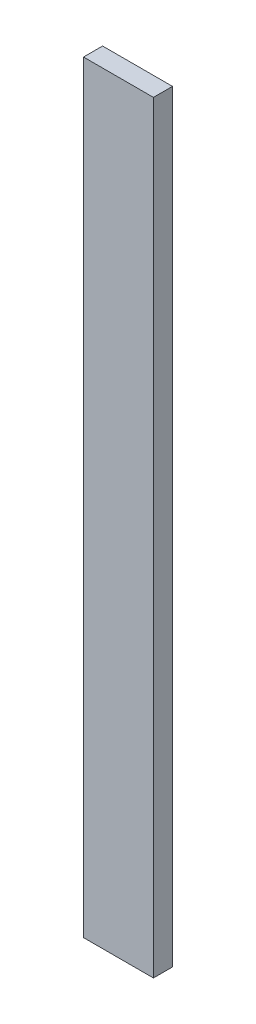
ISO-10303-21;
HEADER;
FILE_DESCRIPTION(('STEP AP214'),'2;1');
FILE_NAME('part.step','',(''),(''),'','','');
FILE_SCHEMA(('AUTOMOTIVE_DESIGN { 1 0 10303 214 1 1 1 1 }'));
ENDSEC;
DATA;
#1=APPLICATION_CONTEXT('core data for automotive mechanical design processes');
#2=APPLICATION_PROTOCOL_DEFINITION('international standard','automotive_design',2000,#1);
#3=PRODUCT_CONTEXT('',#1,'mechanical');
#4=PRODUCT('Part','Part','',(#3));
#5=PRODUCT_RELATED_PRODUCT_CATEGORY('part','',(#4));
#6=PRODUCT_DEFINITION_FORMATION('','',#4);
#7=PRODUCT_DEFINITION_CONTEXT('part definition',#1,'design');
#8=PRODUCT_DEFINITION('design','',#6,#7);
#9=PRODUCT_DEFINITION_SHAPE('','',#8);
#10=(LENGTH_UNIT() NAMED_UNIT(*) SI_UNIT(.MILLI.,.METRE.));
#11=(NAMED_UNIT(*) PLANE_ANGLE_UNIT() SI_UNIT($,.RADIAN.));
#12=(NAMED_UNIT(*) SI_UNIT($,.STERADIAN.) SOLID_ANGLE_UNIT());
#13=UNCERTAINTY_MEASURE_WITH_UNIT(LENGTH_MEASURE(1.E-05),#10,'distance_accuracy_value','');
#14=(GEOMETRIC_REPRESENTATION_CONTEXT(3) GLOBAL_UNCERTAINTY_ASSIGNED_CONTEXT((#13)) GLOBAL_UNIT_ASSIGNED_CONTEXT((#10,
#11,#12)) REPRESENTATION_CONTEXT('',''));
#15=CARTESIAN_POINT('',(0.,0.,0.));
#16=DIRECTION('',(0.,0.,1.));
#17=DIRECTION('',(1.,0.,0.));
#18=AXIS2_PLACEMENT_3D('',#15,#16,#17);
#19=CARTESIAN_POINT('',(69.85,1524.,-19.05));
#20=DIRECTION('',(-1.,0.,0.));
#21=DIRECTION('',(0.,0.,1.));
#22=AXIS2_PLACEMENT_3D('',#19,#20,#21);
#23=PLANE('',#22);
#24=DIRECTION('',(0.,0.,-1.));
#25=VECTOR('',#24,1.);
#26=CARTESIAN_POINT('',(69.85,0.,-19.05));
#27=LINE('',#26,#25);
#28=CARTESIAN_POINT('',(69.85,0.,19.05));
#29=VERTEX_POINT('',#28);
#30=CARTESIAN_POINT('',(69.85,0.,-19.05));
#31=VERTEX_POINT('',#30);
#32=EDGE_CURVE('E99',#29,#31,#27,.T.);
#33=ORIENTED_EDGE('',*,*,#32,.T.);
#34=DIRECTION('',(0.,-1.,0.));
#35=VECTOR('',#34,1.);
#36=CARTESIAN_POINT('',(69.85,1524.,-19.05));
#37=LINE('',#36,#35);
#38=CARTESIAN_POINT('',(69.85,1524.,-19.05));
#39=VERTEX_POINT('',#38);
#40=EDGE_CURVE('E11',#39,#31,#37,.T.);
#41=ORIENTED_EDGE('',*,*,#40,.F.);
#42=DIRECTION('',(0.,0.,-1.));
#43=VECTOR('',#42,1.);
#44=CARTESIAN_POINT('',(69.85,1524.,-19.05));
#45=LINE('',#44,#43);
#46=CARTESIAN_POINT('',(69.85,1524.,19.05));
#47=VERTEX_POINT('',#46);
#48=EDGE_CURVE('E87',#47,#39,#45,.T.);
#49=ORIENTED_EDGE('',*,*,#48,.F.);
#50=DIRECTION('',(0.,-1.,0.));
#51=VECTOR('',#50,1.);
#52=CARTESIAN_POINT('',(69.85,1524.,19.05));
#53=LINE('',#52,#51);
#54=EDGE_CURVE('E95',#47,#29,#53,.T.);
#55=ORIENTED_EDGE('',*,*,#54,.T.);
#56=EDGE_LOOP('',(#33,#41,#49,#55));
#57=FACE_BOUND('',#56,.T.);
#58=ADVANCED_FACE('F36',(#57),#23,.F.);
#59=CARTESIAN_POINT('',(-69.85,1524.,-19.05));
#60=DIRECTION('',(0.,0.,1.));
#61=DIRECTION('',(1.,0.,0.));
#62=AXIS2_PLACEMENT_3D('',#59,#60,#61);
#63=PLANE('',#62);
#64=DIRECTION('',(-1.,0.,0.));
#65=VECTOR('',#64,1.);
#66=CARTESIAN_POINT('',(-69.85,0.,-19.05));
#67=LINE('',#66,#65);
#68=CARTESIAN_POINT('',(-69.85,0.,-19.05));
#69=VERTEX_POINT('',#68);
#70=EDGE_CURVE('E91',#31,#69,#67,.T.);
#71=ORIENTED_EDGE('',*,*,#70,.T.);
#72=DIRECTION('',(0.,-1.,0.));
#73=VECTOR('',#72,1.);
#74=CARTESIAN_POINT('',(-69.85,1524.,-19.05));
#75=LINE('',#74,#73);
#76=CARTESIAN_POINT('',(-69.85,1524.,-19.05));
#77=VERTEX_POINT('',#76);
#78=EDGE_CURVE('E44',#77,#69,#75,.T.);
#79=ORIENTED_EDGE('',*,*,#78,.F.);
#80=DIRECTION('',(-1.,0.,0.));
#81=VECTOR('',#80,1.);
#82=CARTESIAN_POINT('',(-69.85,1524.,-19.05));
#83=LINE('',#82,#81);
#84=EDGE_CURVE('E82',#39,#77,#83,.T.);
#85=ORIENTED_EDGE('',*,*,#84,.F.);
#86=ORIENTED_EDGE('',*,*,#40,.T.);
#87=EDGE_LOOP('',(#71,#79,#85,#86));
#88=FACE_BOUND('',#87,.T.);
#89=ADVANCED_FACE('F90',(#88),#63,.F.);
#90=CARTESIAN_POINT('',(-69.85,1524.,-19.05));
#91=DIRECTION('',(1.,0.,0.));
#92=DIRECTION('',(0.,0.,-1.));
#93=AXIS2_PLACEMENT_3D('',#90,#91,#92);
#94=PLANE('',#93);
#95=DIRECTION('',(0.,0.,1.));
#96=VECTOR('',#95,1.);
#97=CARTESIAN_POINT('',(-69.85,0.,-19.05));
#98=LINE('',#97,#96);
#99=CARTESIAN_POINT('',(-69.85,0.,19.05));
#100=VERTEX_POINT('',#99);
#101=EDGE_CURVE('E69',#69,#100,#98,.T.);
#102=ORIENTED_EDGE('',*,*,#101,.T.);
#103=DIRECTION('',(0.,-1.,0.));
#104=VECTOR('',#103,1.);
#105=CARTESIAN_POINT('',(-69.85,1524.,19.05));
#106=LINE('',#105,#104);
#107=CARTESIAN_POINT('',(-69.85,1524.,19.05));
#108=VERTEX_POINT('',#107);
#109=EDGE_CURVE('E92',#108,#100,#106,.T.);
#110=ORIENTED_EDGE('',*,*,#109,.F.);
#111=DIRECTION('',(0.,0.,1.));
#112=VECTOR('',#111,1.);
#113=CARTESIAN_POINT('',(-69.85,1524.,-19.05));
#114=LINE('',#113,#112);
#115=EDGE_CURVE('E85',#77,#108,#114,.T.);
#116=ORIENTED_EDGE('',*,*,#115,.F.);
#117=ORIENTED_EDGE('',*,*,#78,.T.);
#118=EDGE_LOOP('',(#102,#110,#116,#117));
#119=FACE_BOUND('',#118,.T.);
#120=ADVANCED_FACE('F93',(#119),#94,.F.);
#121=CARTESIAN_POINT('',(-69.85,1524.,19.05));
#122=DIRECTION('',(0.,0.,-1.));
#123=DIRECTION('',(-1.,0.,0.));
#124=AXIS2_PLACEMENT_3D('',#121,#122,#123);
#125=PLANE('',#124);
#126=DIRECTION('',(1.,0.,0.));
#127=VECTOR('',#126,1.);
#128=CARTESIAN_POINT('',(-69.85,0.,19.05));
#129=LINE('',#128,#127);
#130=EDGE_CURVE('E75',#100,#29,#129,.T.);
#131=ORIENTED_EDGE('',*,*,#130,.T.);
#132=ORIENTED_EDGE('',*,*,#54,.F.);
#133=DIRECTION('',(1.,0.,0.));
#134=VECTOR('',#133,1.);
#135=CARTESIAN_POINT('',(-69.85,1524.,19.05));
#136=LINE('',#135,#134);
#137=EDGE_CURVE('E52',#108,#47,#136,.T.);
#138=ORIENTED_EDGE('',*,*,#137,.F.);
#139=ORIENTED_EDGE('',*,*,#109,.T.);
#140=EDGE_LOOP('',(#131,#132,#138,#139));
#141=FACE_BOUND('',#140,.T.);
#142=ADVANCED_FACE('F106',(#141),#125,.F.);
#143=CARTESIAN_POINT('',(0.,1524.,0.));
#144=DIRECTION('',(0.,1.,0.));
#145=DIRECTION('',(0.,0.,1.));
#146=AXIS2_PLACEMENT_3D('',#143,#144,#145);
#147=PLANE('',#146);
#148=ORIENTED_EDGE('',*,*,#48,.T.);
#149=ORIENTED_EDGE('',*,*,#84,.T.);
#150=ORIENTED_EDGE('',*,*,#115,.T.);
#151=ORIENTED_EDGE('',*,*,#137,.T.);
#152=EDGE_LOOP('',(#148,#149,#150,#151));
#153=FACE_BOUND('',#152,.T.);
#154=ADVANCED_FACE('F83',(#153),#147,.T.);
#155=CARTESIAN_POINT('',(0.,0.,0.));
#156=DIRECTION('',(0.,1.,0.));
#157=DIRECTION('',(0.,0.,1.));
#158=AXIS2_PLACEMENT_3D('',#155,#156,#157);
#159=PLANE('',#158);
#160=ORIENTED_EDGE('',*,*,#32,.F.);
#161=ORIENTED_EDGE('',*,*,#130,.F.);
#162=ORIENTED_EDGE('',*,*,#101,.F.);
#163=ORIENTED_EDGE('',*,*,#70,.F.);
#164=EDGE_LOOP('',(#160,#161,#162,#163));
#165=FACE_BOUND('',#164,.T.);
#166=ADVANCED_FACE('F109',(#165),#159,.F.);
#167=CLOSED_SHELL('',(#58,#89,#120,#142,#154,#166));
#168=MANIFOLD_SOLID_BREP('B2',#167);
#169=ADVANCED_BREP_SHAPE_REPRESENTATION('',(#18,#168),#14);
#170=SHAPE_DEFINITION_REPRESENTATION(#9,#169);
ENDSEC;
END-ISO-10303-21;
